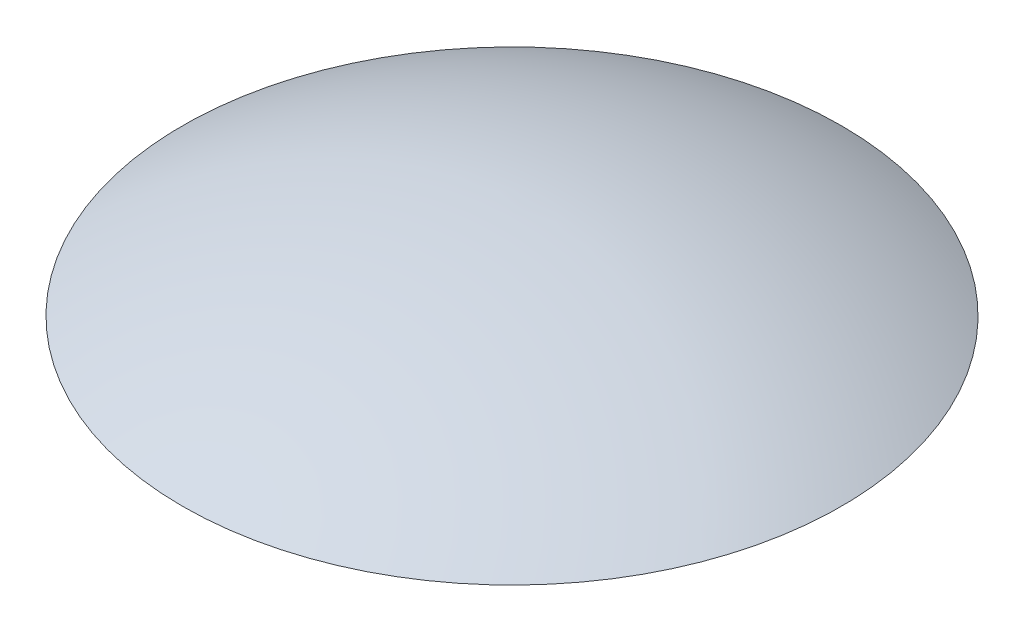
from build123d import *

# Parameters (mm, degrees)
BOSS_EXTRUDE1_DEPTH = 2
BOSS_EXTRUDE1_TAPER = 5


with BuildPart() as part:
    # Sketch2 → Revolve1 (revolve)
    with BuildSketch(Plane(origin=(0, 0, 0), x_dir=(0, 0, -1), z_dir=(1, 0, 0)), mode=Mode.PRIVATE) as revolve1_sk:
        with BuildLine():
            Line((0, 0), (-7.5, 0))
            ThreePointArc((-7.5, 0), (-3.881043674, 1.491413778), (0, 2))
            Line((0, 2), (0, 0))
        make_face()
    revolve(revolve1_sk.sketch.rotate(Axis((0, 0, 0), (0, -1, 0)), 180), axis=Axis((0, 0, 0), (0, -1, 0)))

    # Sketch3 → Boss-Extrude1 (add)
    with BuildSketch(Plane.XZ):
        Polygon((0.75, 3), (-0.75, 3), (-0.75, 0.75), (-3, 0.75), (-3, -0.75), (-0.75, -0.75), (-0.75, -3), (0.75, -3), (0.75, -0.75), (3, -0.75), (3, 0.75), (0.75, 0.75), align=None)
    extrude(amount=BOSS_EXTRUDE1_DEPTH, taper=BOSS_EXTRUDE1_TAPER)


solid = part.part
